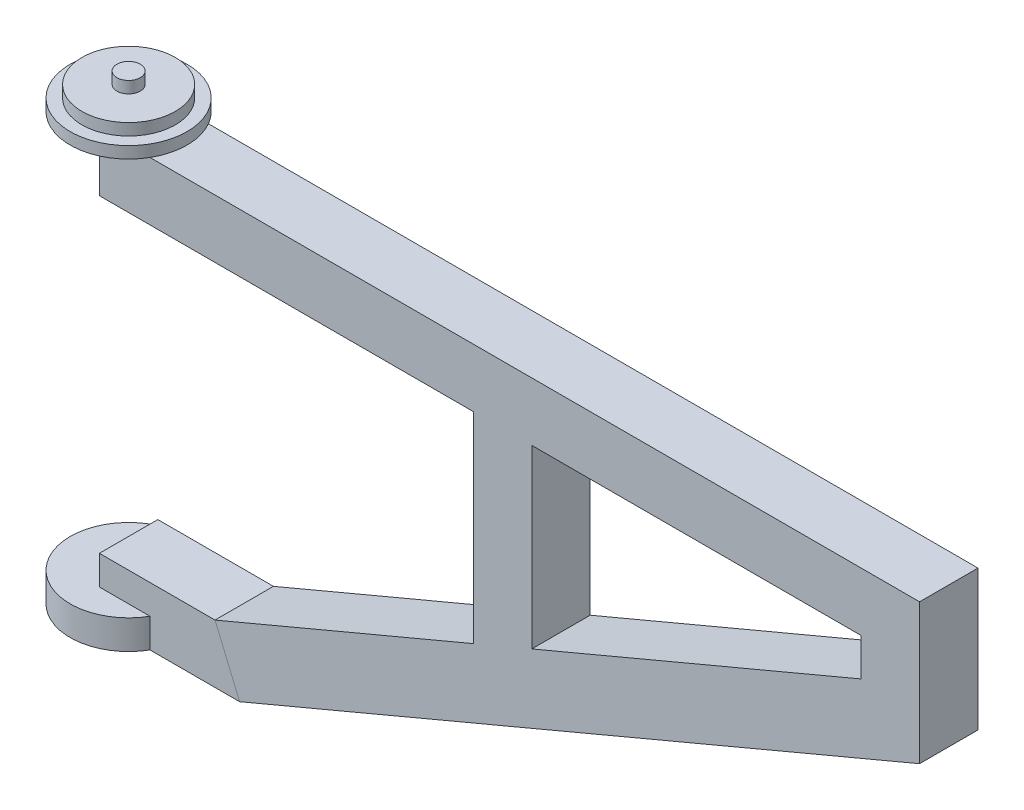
ISO-10303-21;
HEADER;
FILE_DESCRIPTION(('STEP AP214'),'2;1');
FILE_NAME('part.step','',(''),(''),'','','');
FILE_SCHEMA(('AUTOMOTIVE_DESIGN { 1 0 10303 214 1 1 1 1 }'));
ENDSEC;
DATA;
#1=APPLICATION_CONTEXT('core data for automotive mechanical design processes');
#2=APPLICATION_PROTOCOL_DEFINITION('international standard','automotive_design',2000,#1);
#3=PRODUCT_CONTEXT('',#1,'mechanical');
#4=PRODUCT('Part','Part','',(#3));
#5=PRODUCT_RELATED_PRODUCT_CATEGORY('part','',(#4));
#6=PRODUCT_DEFINITION_FORMATION('','',#4);
#7=PRODUCT_DEFINITION_CONTEXT('part definition',#1,'design');
#8=PRODUCT_DEFINITION('design','',#6,#7);
#9=PRODUCT_DEFINITION_SHAPE('','',#8);
#10=(LENGTH_UNIT() NAMED_UNIT(*) SI_UNIT(.MILLI.,.METRE.));
#11=(NAMED_UNIT(*) PLANE_ANGLE_UNIT() SI_UNIT($,.RADIAN.));
#12=(NAMED_UNIT(*) SI_UNIT($,.STERADIAN.) SOLID_ANGLE_UNIT());
#13=UNCERTAINTY_MEASURE_WITH_UNIT(LENGTH_MEASURE(1.E-05),#10,'distance_accuracy_value','');
#14=(GEOMETRIC_REPRESENTATION_CONTEXT(3) GLOBAL_UNCERTAINTY_ASSIGNED_CONTEXT((#13)) GLOBAL_UNIT_ASSIGNED_CONTEXT((#10,
#11,#12)) REPRESENTATION_CONTEXT('',''));
#15=CARTESIAN_POINT('',(0.,0.,0.));
#16=DIRECTION('',(0.,0.,1.));
#17=DIRECTION('',(1.,0.,0.));
#18=AXIS2_PLACEMENT_3D('',#15,#16,#17);
#19=CARTESIAN_POINT('',(0.,-438.15,31.75));
#20=DIRECTION('',(0.,0.,1.));
#21=DIRECTION('',(1.,0.,0.));
#22=AXIS2_PLACEMENT_3D('',#19,#20,#21);
#23=PLANE('',#22);
#24=DIRECTION('',(0.,1.,0.));
#25=VECTOR('',#24,1.);
#26=CARTESIAN_POINT('',(827.891767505,-38.1,31.75));
#27=LINE('',#26,#25);
#28=CARTESIAN_POINT('',(827.891767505,-142.47916429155,31.75));
#29=VERTEX_POINT('',#28);
#30=CARTESIAN_POINT('',(827.891767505,-101.6,31.75));
#31=VERTEX_POINT('',#30);
#32=EDGE_CURVE('E200',#29,#31,#27,.T.);
#33=ORIENTED_EDGE('',*,*,#32,.F.);
#34=DIRECTION('',(-0.921637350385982,-0.388052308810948,0.));
#35=VECTOR('',#34,1.);
#36=CARTESIAN_POINT('',(864.655305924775,-127.,31.75));
#37=LINE('',#36,#35);
#38=CARTESIAN_POINT('',(469.9,-293.2103948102,31.75));
#39=VERTEX_POINT('',#38);
#40=EDGE_CURVE('E162',#29,#39,#37,.T.);
#41=ORIENTED_EDGE('',*,*,#40,.T.);
#42=DIRECTION('',(0.,-1.,0.));
#43=VECTOR('',#42,1.);
#44=CARTESIAN_POINT('',(469.9,-38.1,31.75));
#45=LINE('',#44,#43);
#46=CARTESIAN_POINT('',(469.9,-101.6,31.75));
#47=VERTEX_POINT('',#46);
#48=EDGE_CURVE('E281',#47,#39,#45,.T.);
#49=ORIENTED_EDGE('',*,*,#48,.F.);
#50=DIRECTION('',(-1.,0.,0.));
#51=VECTOR('',#50,1.);
#52=CARTESIAN_POINT('',(0.,-101.6,31.75));
#53=LINE('',#52,#51);
#54=EDGE_CURVE('E194',#31,#47,#53,.T.);
#55=ORIENTED_EDGE('',*,*,#54,.F.);
#56=EDGE_LOOP('',(#33,#41,#49,#55));
#57=FACE_BOUND('',#56,.T.);
#58=DIRECTION('',(-0.921637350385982,-0.388052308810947,0.));
#59=VECTOR('',#58,1.);
#60=CARTESIAN_POINT('',(152.4,-501.65,31.75));
#61=LINE('',#60,#59);
#62=CARTESIAN_POINT('',(891.391767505,-190.5,31.75));
#63=VERTEX_POINT('',#62);
#64=CARTESIAN_POINT('',(152.4,-501.65,31.75));
#65=VERTEX_POINT('',#64);
#66=EDGE_CURVE('E65',#63,#65,#61,.T.);
#67=ORIENTED_EDGE('',*,*,#66,.F.);
#68=DIRECTION('',(0.,-1.,0.));
#69=VECTOR('',#68,1.);
#70=CARTESIAN_POINT('',(891.391767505,-438.15,31.75));
#71=LINE('',#70,#69);
#72=CARTESIAN_POINT('',(891.391767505,-38.1,31.75));
#73=VERTEX_POINT('',#72);
#74=EDGE_CURVE('E199',#73,#63,#71,.T.);
#75=ORIENTED_EDGE('',*,*,#74,.F.);
#76=DIRECTION('',(1.,0.,0.));
#77=VECTOR('',#76,1.);
#78=CARTESIAN_POINT('',(891.391767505,-38.1,31.75));
#79=LINE('',#78,#77);
#80=CARTESIAN_POINT('',(54.9926131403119,-38.1,31.75));
#81=VERTEX_POINT('',#80);
#82=EDGE_CURVE('E221',#81,#73,#79,.T.);
#83=ORIENTED_EDGE('',*,*,#82,.F.);
#84=DIRECTION('',(-1.,0.,0.));
#85=VECTOR('',#84,1.);
#86=CARTESIAN_POINT('',(0.,-38.1,31.75));
#87=LINE('',#86,#85);
#88=CARTESIAN_POINT('',(0.,-38.1,31.75));
#89=VERTEX_POINT('',#88);
#90=EDGE_CURVE('E182',#81,#89,#87,.T.);
#91=ORIENTED_EDGE('',*,*,#90,.T.);
#92=DIRECTION('',(0.,1.,0.));
#93=VECTOR('',#92,1.);
#94=CARTESIAN_POINT('',(0.,-101.6,31.75));
#95=LINE('',#94,#93);
#96=CARTESIAN_POINT('',(0.,-101.6,31.75));
#97=VERTEX_POINT('',#96);
#98=EDGE_CURVE('E252',#97,#89,#95,.T.);
#99=ORIENTED_EDGE('',*,*,#98,.F.);
#100=CARTESIAN_POINT('',(406.4,-101.6,31.75));
#101=VERTEX_POINT('',#100);
#102=EDGE_CURVE('E187',#101,#97,#53,.T.);
#103=ORIENTED_EDGE('',*,*,#102,.F.);
#104=DIRECTION('',(0.,1.,0.));
#105=VECTOR('',#104,1.);
#106=CARTESIAN_POINT('',(406.4,-38.1,31.75));
#107=LINE('',#106,#105);
#108=CARTESIAN_POINT('',(406.4,-319.946856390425,31.75));
#109=VERTEX_POINT('',#108);
#110=EDGE_CURVE('E285',#109,#101,#107,.T.);
#111=ORIENTED_EDGE('',*,*,#110,.F.);
#112=CARTESIAN_POINT('',(125.663538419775,-438.15,31.75));
#113=VERTEX_POINT('',#112);
#114=EDGE_CURVE('E158',#109,#113,#37,.T.);
#115=ORIENTED_EDGE('',*,*,#114,.T.);
#116=DIRECTION('',(0.388052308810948,-0.921637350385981,0.));
#117=VECTOR('',#116,1.);
#118=CARTESIAN_POINT('',(125.663538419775,-438.15,31.75));
#119=LINE('',#118,#117);
#120=EDGE_CURVE('E151',#113,#65,#119,.T.);
#121=ORIENTED_EDGE('',*,*,#120,.T.);
#122=EDGE_LOOP('',(#67,#75,#83,#91,#99,#103,#111,#115,#121));
#123=FACE_BOUND('',#122,.T.);
#124=ADVANCED_FACE('F49',(#57,#123),#23,.T.);
#125=CARTESIAN_POINT('',(0.,-101.6,0.));
#126=DIRECTION('',(0.,1.,0.));
#127=DIRECTION('',(0.,0.,1.));
#128=AXIS2_PLACEMENT_3D('',#125,#126,#127);
#129=PLANE('',#128);
#130=DIRECTION('',(1.,0.,0.));
#131=VECTOR('',#130,1.);
#132=CARTESIAN_POINT('',(0.,-101.6,-31.75));
#133=LINE('',#132,#131);
#134=CARTESIAN_POINT('',(0.,-101.6,-31.75));
#135=VERTEX_POINT('',#134);
#136=CARTESIAN_POINT('',(406.4,-101.6,-31.7499999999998));
#137=VERTEX_POINT('',#136);
#138=EDGE_CURVE('E188',#135,#137,#133,.T.);
#139=ORIENTED_EDGE('',*,*,#138,.T.);
#140=DIRECTION('',(0.,0.,1.));
#141=VECTOR('',#140,1.);
#142=CARTESIAN_POINT('',(406.4,-101.6,0.));
#143=LINE('',#142,#141);
#144=EDGE_CURVE('E183',#137,#101,#143,.T.);
#145=ORIENTED_EDGE('',*,*,#144,.T.);
#146=ORIENTED_EDGE('',*,*,#102,.T.);
#147=DIRECTION('',(0.,0.,-1.));
#148=VECTOR('',#147,1.);
#149=CARTESIAN_POINT('',(0.,-101.6,-31.75));
#150=LINE('',#149,#148);
#151=EDGE_CURVE('E227',#97,#135,#150,.T.);
#152=ORIENTED_EDGE('',*,*,#151,.T.);
#153=EDGE_LOOP('',(#139,#145,#146,#152));
#154=FACE_BOUND('',#153,.T.);
#155=ADVANCED_FACE('F321',(#154),#129,.F.);
#156=CARTESIAN_POINT('',(827.891767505,-38.1,31.75));
#157=DIRECTION('',(-1.,0.,0.));
#158=DIRECTION('',(0.,-1.,0.));
#159=AXIS2_PLACEMENT_3D('',#156,#157,#158);
#160=PLANE('',#159);
#161=DIRECTION('',(0.,0.,-1.));
#162=VECTOR('',#161,1.);
#163=CARTESIAN_POINT('',(827.891767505,-142.47916429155,31.75));
#164=LINE('',#163,#162);
#165=CARTESIAN_POINT('',(827.891767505,-142.47916429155,-31.7499999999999));
#166=VERTEX_POINT('',#165);
#167=EDGE_CURVE('E179',#29,#166,#164,.T.);
#168=ORIENTED_EDGE('',*,*,#167,.F.);
#169=ORIENTED_EDGE('',*,*,#32,.T.);
#170=DIRECTION('',(0.,0.,-1.));
#171=VECTOR('',#170,1.);
#172=CARTESIAN_POINT('',(827.891767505,-101.6,31.75));
#173=LINE('',#172,#171);
#174=CARTESIAN_POINT('',(827.891767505,-101.6,-31.75));
#175=VERTEX_POINT('',#174);
#176=EDGE_CURVE('E195',#31,#175,#173,.T.);
#177=ORIENTED_EDGE('',*,*,#176,.T.);
#178=DIRECTION('',(0.,1.,0.));
#179=VECTOR('',#178,1.);
#180=CARTESIAN_POINT('',(827.891767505,-38.1,-31.75));
#181=LINE('',#180,#179);
#182=EDGE_CURVE('E205',#166,#175,#181,.T.);
#183=ORIENTED_EDGE('',*,*,#182,.F.);
#184=EDGE_LOOP('',(#168,#169,#177,#183));
#185=FACE_BOUND('',#184,.T.);
#186=ADVANCED_FACE('F318',(#185),#160,.T.);
#187=CARTESIAN_POINT('',(891.391767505,-438.15,31.75));
#188=DIRECTION('',(1.,0.,0.));
#189=DIRECTION('',(0.,0.,-1.));
#190=AXIS2_PLACEMENT_3D('',#187,#188,#189);
#191=PLANE('',#190);
#192=DIRECTION('',(0.,0.,1.));
#193=VECTOR('',#192,1.);
#194=CARTESIAN_POINT('',(891.391767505,-190.5,-63.5));
#195=LINE('',#194,#193);
#196=CARTESIAN_POINT('',(891.391767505,-190.5,-31.75));
#197=VERTEX_POINT('',#196);
#198=EDGE_CURVE('E58',#197,#63,#195,.T.);
#199=ORIENTED_EDGE('',*,*,#198,.F.);
#200=DIRECTION('',(0.,-1.,0.));
#201=VECTOR('',#200,1.);
#202=CARTESIAN_POINT('',(891.391767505,-438.15,-31.75));
#203=LINE('',#202,#201);
#204=CARTESIAN_POINT('',(891.391767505,-38.1,-31.75));
#205=VERTEX_POINT('',#204);
#206=EDGE_CURVE('E201',#205,#197,#203,.T.);
#207=ORIENTED_EDGE('',*,*,#206,.F.);
#208=DIRECTION('',(0.,0.,-1.));
#209=VECTOR('',#208,1.);
#210=CARTESIAN_POINT('',(891.391767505,-38.1,31.75));
#211=LINE('',#210,#209);
#212=EDGE_CURVE('E210',#73,#205,#211,.T.);
#213=ORIENTED_EDGE('',*,*,#212,.F.);
#214=ORIENTED_EDGE('',*,*,#74,.T.);
#215=EDGE_LOOP('',(#199,#207,#213,#214));
#216=FACE_BOUND('',#215,.T.);
#217=ADVANCED_FACE('F320',(#216),#191,.T.);
#218=CARTESIAN_POINT('',(0.,-438.15,-31.75));
#219=DIRECTION('',(0.,0.,-1.));
#220=DIRECTION('',(-1.,0.,0.));
#221=AXIS2_PLACEMENT_3D('',#218,#219,#220);
#222=PLANE('',#221);
#223=DIRECTION('',(-0.921637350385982,-0.388052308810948,0.));
#224=VECTOR('',#223,1.);
#225=CARTESIAN_POINT('',(864.655305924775,-127.,-31.7499999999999));
#226=LINE('',#225,#224);
#227=CARTESIAN_POINT('',(469.9,-293.2103948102,-31.7499999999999));
#228=VERTEX_POINT('',#227);
#229=EDGE_CURVE('E166',#166,#228,#226,.T.);
#230=ORIENTED_EDGE('',*,*,#229,.F.);
#231=ORIENTED_EDGE('',*,*,#182,.T.);
#232=CARTESIAN_POINT('',(469.9,-101.6,-31.75));
#233=VERTEX_POINT('',#232);
#234=EDGE_CURVE('E193',#233,#175,#133,.T.);
#235=ORIENTED_EDGE('',*,*,#234,.F.);
#236=DIRECTION('',(0.,-1.,0.));
#237=VECTOR('',#236,1.);
#238=CARTESIAN_POINT('',(469.9,-38.1,-31.75));
#239=LINE('',#238,#237);
#240=EDGE_CURVE('E215',#233,#228,#239,.T.);
#241=ORIENTED_EDGE('',*,*,#240,.T.);
#242=EDGE_LOOP('',(#230,#231,#235,#241));
#243=FACE_BOUND('',#242,.T.);
#244=ORIENTED_EDGE('',*,*,#206,.T.);
#245=DIRECTION('',(0.921637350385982,0.388052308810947,0.));
#246=VECTOR('',#245,1.);
#247=CARTESIAN_POINT('',(45.6594545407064,-546.592747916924,-31.75));
#248=LINE('',#247,#246);
#249=CARTESIAN_POINT('',(152.4,-501.65,-31.7499999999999));
#250=VERTEX_POINT('',#249);
#251=EDGE_CURVE('E72',#250,#197,#248,.T.);
#252=ORIENTED_EDGE('',*,*,#251,.F.);
#253=DIRECTION('',(0.388052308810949,-0.921637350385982,0.));
#254=VECTOR('',#253,1.);
#255=CARTESIAN_POINT('',(125.663538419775,-438.15,-31.7499999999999));
#256=LINE('',#255,#254);
#257=CARTESIAN_POINT('',(125.663538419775,-438.15,-31.7499999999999));
#258=VERTEX_POINT('',#257);
#259=EDGE_CURVE('E153',#258,#250,#256,.T.);
#260=ORIENTED_EDGE('',*,*,#259,.F.);
#261=CARTESIAN_POINT('',(406.4,-319.946856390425,-31.7499999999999));
#262=VERTEX_POINT('',#261);
#263=EDGE_CURVE('E161',#262,#258,#226,.T.);
#264=ORIENTED_EDGE('',*,*,#263,.F.);
#265=DIRECTION('',(0.,1.,0.));
#266=VECTOR('',#265,1.);
#267=CARTESIAN_POINT('',(406.4,-38.1,-31.75));
#268=LINE('',#267,#266);
#269=EDGE_CURVE('E209',#262,#137,#268,.T.);
#270=ORIENTED_EDGE('',*,*,#269,.T.);
#271=ORIENTED_EDGE('',*,*,#138,.F.);
#272=DIRECTION('',(0.,1.,0.));
#273=VECTOR('',#272,1.);
#274=CARTESIAN_POINT('',(0.,-101.6,-31.75));
#275=LINE('',#274,#273);
#276=CARTESIAN_POINT('',(0.,-38.1,-31.75));
#277=VERTEX_POINT('',#276);
#278=EDGE_CURVE('E256',#135,#277,#275,.T.);
#279=ORIENTED_EDGE('',*,*,#278,.T.);
#280=DIRECTION('',(1.,0.,0.));
#281=VECTOR('',#280,1.);
#282=CARTESIAN_POINT('',(0.,-38.1,-31.75));
#283=LINE('',#282,#281);
#284=CARTESIAN_POINT('',(54.9926131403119,-38.1,-31.75));
#285=VERTEX_POINT('',#284);
#286=EDGE_CURVE('E218',#277,#285,#283,.T.);
#287=ORIENTED_EDGE('',*,*,#286,.T.);
#288=DIRECTION('',(1.,0.,0.));
#289=VECTOR('',#288,1.);
#290=CARTESIAN_POINT('',(891.391767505,-38.1,-31.75));
#291=LINE('',#290,#289);
#292=EDGE_CURVE('E206',#285,#205,#291,.T.);
#293=ORIENTED_EDGE('',*,*,#292,.T.);
#294=EDGE_LOOP('',(#244,#252,#260,#264,#270,#271,#279,#287,#293));
#295=FACE_BOUND('',#294,.T.);
#296=ADVANCED_FACE('F309',(#243,#295),#222,.T.);
#297=CARTESIAN_POINT('',(891.391767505,-38.1,31.75));
#298=DIRECTION('',(0.,1.,0.));
#299=DIRECTION('',(0.,0.,1.));
#300=AXIS2_PLACEMENT_3D('',#297,#298,#299);
#301=PLANE('',#300);
#302=ORIENTED_EDGE('',*,*,#212,.T.);
#303=ORIENTED_EDGE('',*,*,#292,.F.);
#304=CARTESIAN_POINT('',(0.,-38.1,0.));
#305=DIRECTION('',(0.,-1.,0.));
#306=DIRECTION('',(0.,0.,-1.));
#307=AXIS2_PLACEMENT_3D('',#304,#305,#306);
#308=CIRCLE('',#307,63.5);
#309=EDGE_CURVE('E214',#285,#81,#308,.T.);
#310=ORIENTED_EDGE('',*,*,#309,.T.);
#311=ORIENTED_EDGE('',*,*,#82,.T.);
#312=EDGE_LOOP('',(#302,#303,#310,#311));
#313=FACE_BOUND('',#312,.T.);
#314=ADVANCED_FACE('F338',(#313),#301,.T.);
#315=CARTESIAN_POINT('',(0.,-12.7,0.));
#316=DIRECTION('',(0.,1.,0.));
#317=DIRECTION('',(0.,0.,1.));
#318=AXIS2_PLACEMENT_3D('',#315,#316,#317);
#319=CYLINDRICAL_SURFACE('',#318,12.7);
#320=CARTESIAN_POINT('',(0.,-12.7,0.));
#321=DIRECTION('',(0.,1.,0.));
#322=DIRECTION('',(0.,0.,1.));
#323=AXIS2_PLACEMENT_3D('',#320,#321,#322);
#324=CIRCLE('',#323,12.7);
#325=CARTESIAN_POINT('',(0.,-12.7,12.7));
#326=VERTEX_POINT('',#325);
#327=EDGE_CURVE('E224',#326,#326,#324,.T.);
#328=ORIENTED_EDGE('',*,*,#327,.T.);
#329=EDGE_LOOP('',(#328));
#330=FACE_BOUND('',#329,.T.);
#331=CARTESIAN_POINT('',(0.,0.,0.));
#332=DIRECTION('',(0.,1.,0.));
#333=DIRECTION('',(0.,0.,1.));
#334=AXIS2_PLACEMENT_3D('',#331,#332,#333);
#335=CIRCLE('',#334,12.7);
#336=CARTESIAN_POINT('',(0.,0.,12.7));
#337=VERTEX_POINT('',#336);
#338=EDGE_CURVE('E228',#337,#337,#335,.T.);
#339=ORIENTED_EDGE('',*,*,#338,.F.);
#340=EDGE_LOOP('',(#339));
#341=FACE_BOUND('',#340,.T.);
#342=ADVANCED_FACE('F373',(#330,#341),#319,.T.);
#343=CARTESIAN_POINT('',(0.,0.,0.));
#344=DIRECTION('',(0.,1.,0.));
#345=DIRECTION('',(0.,0.,1.));
#346=AXIS2_PLACEMENT_3D('',#343,#344,#345);
#347=PLANE('',#346);
#348=ORIENTED_EDGE('',*,*,#338,.T.);
#349=EDGE_LOOP('',(#348));
#350=FACE_BOUND('',#349,.T.);
#351=ADVANCED_FACE('F369',(#350),#347,.T.);
#352=CARTESIAN_POINT('',(0.,-25.4,0.));
#353=DIRECTION('',(0.,1.,0.));
#354=DIRECTION('',(0.,0.,1.));
#355=AXIS2_PLACEMENT_3D('',#352,#353,#354);
#356=CYLINDRICAL_SURFACE('',#355,50.8);
#357=CARTESIAN_POINT('',(0.,-25.4,0.));
#358=DIRECTION('',(0.,-1.,0.));
#359=DIRECTION('',(0.,0.,-1.));
#360=AXIS2_PLACEMENT_3D('',#357,#358,#359);
#361=CIRCLE('',#360,50.8);
#362=CARTESIAN_POINT('',(0.,-25.4,-50.8));
#363=VERTEX_POINT('',#362);
#364=EDGE_CURVE('E240',#363,#363,#361,.T.);
#365=ORIENTED_EDGE('',*,*,#364,.F.);
#366=EDGE_LOOP('',(#365));
#367=FACE_BOUND('',#366,.T.);
#368=CARTESIAN_POINT('',(0.,-12.7,0.));
#369=DIRECTION('',(0.,-1.,0.));
#370=DIRECTION('',(0.,0.,-1.));
#371=AXIS2_PLACEMENT_3D('',#368,#369,#370);
#372=CIRCLE('',#371,50.8);
#373=CARTESIAN_POINT('',(0.,-12.7,-50.8));
#374=VERTEX_POINT('',#373);
#375=EDGE_CURVE('E232',#374,#374,#372,.T.);
#376=ORIENTED_EDGE('',*,*,#375,.T.);
#377=EDGE_LOOP('',(#376));
#378=FACE_BOUND('',#377,.T.);
#379=ADVANCED_FACE('F365',(#367,#378),#356,.T.);
#380=CARTESIAN_POINT('',(0.,-12.7,0.));
#381=DIRECTION('',(0.,-1.,0.));
#382=DIRECTION('',(0.,0.,-1.));
#383=AXIS2_PLACEMENT_3D('',#380,#381,#382);
#384=PLANE('',#383);
#385=ORIENTED_EDGE('',*,*,#327,.F.);
#386=EDGE_LOOP('',(#385));
#387=FACE_BOUND('',#386,.T.);
#388=ORIENTED_EDGE('',*,*,#375,.F.);
#389=EDGE_LOOP('',(#388));
#390=FACE_BOUND('',#389,.T.);
#391=ADVANCED_FACE('F361',(#387,#390),#384,.F.);
#392=CARTESIAN_POINT('',(0.,-38.1,0.));
#393=DIRECTION('',(0.,1.,0.));
#394=DIRECTION('',(0.,0.,1.));
#395=AXIS2_PLACEMENT_3D('',#392,#393,#394);
#396=CYLINDRICAL_SURFACE('',#395,63.5);
#397=ORIENTED_EDGE('',*,*,#309,.F.);
#398=EDGE_CURVE('E245',#81,#285,#308,.T.);
#399=ORIENTED_EDGE('',*,*,#398,.F.);
#400=EDGE_LOOP('',(#397,#399));
#401=FACE_BOUND('',#400,.T.);
#402=CARTESIAN_POINT('',(0.,-25.4,0.));
#403=DIRECTION('',(0.,-1.,0.));
#404=DIRECTION('',(0.,0.,-1.));
#405=AXIS2_PLACEMENT_3D('',#402,#403,#404);
#406=CIRCLE('',#405,63.5);
#407=CARTESIAN_POINT('',(0.,-25.4,-63.5));
#408=VERTEX_POINT('',#407);
#409=EDGE_CURVE('E239',#408,#408,#406,.T.);
#410=ORIENTED_EDGE('',*,*,#409,.T.);
#411=EDGE_LOOP('',(#410));
#412=FACE_BOUND('',#411,.T.);
#413=ADVANCED_FACE('F354',(#401,#412),#396,.T.);
#414=CARTESIAN_POINT('',(0.,-38.1,0.));
#415=DIRECTION('',(0.,-1.,0.));
#416=DIRECTION('',(0.,0.,-1.));
#417=AXIS2_PLACEMENT_3D('',#414,#415,#416);
#418=PLANE('',#417);
#419=ORIENTED_EDGE('',*,*,#286,.F.);
#420=DIRECTION('',(0.,0.,-1.));
#421=VECTOR('',#420,1.);
#422=CARTESIAN_POINT('',(0.,-38.1,-31.75));
#423=LINE('',#422,#421);
#424=EDGE_CURVE('E244',#89,#277,#423,.T.);
#425=ORIENTED_EDGE('',*,*,#424,.F.);
#426=ORIENTED_EDGE('',*,*,#90,.F.);
#427=ORIENTED_EDGE('',*,*,#398,.T.);
#428=EDGE_LOOP('',(#419,#425,#426,#427));
#429=FACE_BOUND('',#428,.T.);
#430=ADVANCED_FACE('F351',(#429),#418,.T.);
#431=CARTESIAN_POINT('',(0.,-25.4,0.));
#432=DIRECTION('',(0.,-1.,0.));
#433=DIRECTION('',(0.,0.,-1.));
#434=AXIS2_PLACEMENT_3D('',#431,#432,#433);
#435=PLANE('',#434);
#436=ORIENTED_EDGE('',*,*,#364,.T.);
#437=EDGE_LOOP('',(#436));
#438=FACE_BOUND('',#437,.T.);
#439=ORIENTED_EDGE('',*,*,#409,.F.);
#440=EDGE_LOOP('',(#439));
#441=FACE_BOUND('',#440,.T.);
#442=ADVANCED_FACE('F349',(#438,#441),#435,.F.);
#443=CARTESIAN_POINT('',(0.,-101.6,-31.75));
#444=DIRECTION('',(1.,0.,0.));
#445=DIRECTION('',(0.,0.,-1.));
#446=AXIS2_PLACEMENT_3D('',#443,#444,#445);
#447=PLANE('',#446);
#448=ORIENTED_EDGE('',*,*,#424,.T.);
#449=ORIENTED_EDGE('',*,*,#278,.F.);
#450=ORIENTED_EDGE('',*,*,#151,.F.);
#451=ORIENTED_EDGE('',*,*,#98,.T.);
#452=EDGE_LOOP('',(#448,#449,#450,#451));
#453=FACE_BOUND('',#452,.T.);
#454=ADVANCED_FACE('F346',(#453),#447,.F.);
#455=ORIENTED_EDGE('',*,*,#54,.T.);
#456=DIRECTION('',(0.,0.,-1.));
#457=VECTOR('',#456,1.);
#458=CARTESIAN_POINT('',(469.9,-101.6,0.));
#459=LINE('',#458,#457);
#460=EDGE_CURVE('E189',#47,#233,#459,.T.);
#461=ORIENTED_EDGE('',*,*,#460,.T.);
#462=ORIENTED_EDGE('',*,*,#234,.T.);
#463=ORIENTED_EDGE('',*,*,#176,.F.);
#464=EDGE_LOOP('',(#455,#461,#462,#463));
#465=FACE_BOUND('',#464,.T.);
#466=ADVANCED_FACE('F313',(#465),#129,.F.);
#467=CARTESIAN_POINT('',(406.4,-38.1,31.75));
#468=DIRECTION('',(-1.,0.,0.));
#469=DIRECTION('',(0.,-1.,0.));
#470=AXIS2_PLACEMENT_3D('',#467,#468,#469);
#471=PLANE('',#470);
#472=DIRECTION('',(0.,0.,-1.));
#473=VECTOR('',#472,1.);
#474=CARTESIAN_POINT('',(406.4,-319.946856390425,31.75));
#475=LINE('',#474,#473);
#476=EDGE_CURVE('E155',#109,#262,#475,.T.);
#477=ORIENTED_EDGE('',*,*,#476,.F.);
#478=ORIENTED_EDGE('',*,*,#110,.T.);
#479=ORIENTED_EDGE('',*,*,#144,.F.);
#480=ORIENTED_EDGE('',*,*,#269,.F.);
#481=EDGE_LOOP('',(#477,#478,#479,#480));
#482=FACE_BOUND('',#481,.T.);
#483=ADVANCED_FACE('F341',(#482),#471,.T.);
#484=CARTESIAN_POINT('',(469.9,-38.1,31.75));
#485=DIRECTION('',(1.,0.,0.));
#486=DIRECTION('',(0.,1.,0.));
#487=AXIS2_PLACEMENT_3D('',#484,#485,#486);
#488=PLANE('',#487);
#489=DIRECTION('',(0.,0.,1.));
#490=VECTOR('',#489,1.);
#491=CARTESIAN_POINT('',(469.9,-293.2103948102,31.75));
#492=LINE('',#491,#490);
#493=EDGE_CURVE('E12',#228,#39,#492,.T.);
#494=ORIENTED_EDGE('',*,*,#493,.F.);
#495=ORIENTED_EDGE('',*,*,#240,.F.);
#496=ORIENTED_EDGE('',*,*,#460,.F.);
#497=ORIENTED_EDGE('',*,*,#48,.T.);
#498=EDGE_LOOP('',(#494,#495,#496,#497));
#499=FACE_BOUND('',#498,.T.);
#500=ADVANCED_FACE('F306',(#499),#488,.T.);
#501=CARTESIAN_POINT('',(152.4,-501.65,-63.5));
#502=DIRECTION('',(-0.388052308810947,0.921637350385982,0.));
#503=DIRECTION('',(-0.921637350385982,-0.388052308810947,0.));
#504=AXIS2_PLACEMENT_3D('',#501,#502,#503);
#505=PLANE('',#504);
#506=ORIENTED_EDGE('',*,*,#66,.T.);
#507=DIRECTION('',(0.,0.,1.));
#508=VECTOR('',#507,1.);
#509=CARTESIAN_POINT('',(152.4,-501.65,-884.218382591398));
#510=LINE('',#509,#508);
#511=EDGE_CURVE('E143',#250,#65,#510,.T.);
#512=ORIENTED_EDGE('',*,*,#511,.F.);
#513=ORIENTED_EDGE('',*,*,#251,.T.);
#514=ORIENTED_EDGE('',*,*,#198,.T.);
#515=EDGE_LOOP('',(#506,#512,#513,#514));
#516=FACE_BOUND('',#515,.T.);
#517=ADVANCED_FACE('F51',(#516),#505,.F.);
#518=CARTESIAN_POINT('',(864.655305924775,-127.,-884.218382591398));
#519=DIRECTION('',(-0.388052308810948,0.921637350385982,0.));
#520=DIRECTION('',(-0.921637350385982,-0.388052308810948,0.));
#521=AXIS2_PLACEMENT_3D('',#518,#519,#520);
#522=PLANE('',#521);
#523=ORIENTED_EDGE('',*,*,#40,.F.);
#524=ORIENTED_EDGE('',*,*,#167,.T.);
#525=ORIENTED_EDGE('',*,*,#229,.T.);
#526=ORIENTED_EDGE('',*,*,#493,.T.);
#527=EDGE_LOOP('',(#523,#524,#525,#526));
#528=FACE_BOUND('',#527,.T.);
#529=ADVANCED_FACE('F300',(#528),#522,.T.);
#530=ORIENTED_EDGE('',*,*,#114,.F.);
#531=ORIENTED_EDGE('',*,*,#476,.T.);
#532=ORIENTED_EDGE('',*,*,#263,.T.);
#533=DIRECTION('',(0.,0.,1.));
#534=VECTOR('',#533,1.);
#535=CARTESIAN_POINT('',(125.663538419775,-438.15,-884.218382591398));
#536=LINE('',#535,#534);
#537=EDGE_CURVE('E173',#258,#113,#536,.T.);
#538=ORIENTED_EDGE('',*,*,#537,.T.);
#539=EDGE_LOOP('',(#530,#531,#532,#538));
#540=FACE_BOUND('',#539,.T.);
#541=ADVANCED_FACE('F399',(#540),#522,.T.);
#542=CARTESIAN_POINT('',(125.663538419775,-438.15,-884.218382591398));
#543=DIRECTION('',(-0.921637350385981,-0.388052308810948,0.));
#544=DIRECTION('',(0.388052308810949,-0.921637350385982,0.));
#545=AXIS2_PLACEMENT_3D('',#542,#543,#544);
#546=PLANE('',#545);
#547=ORIENTED_EDGE('',*,*,#537,.F.);
#548=ORIENTED_EDGE('',*,*,#259,.T.);
#549=ORIENTED_EDGE('',*,*,#511,.T.);
#550=ORIENTED_EDGE('',*,*,#120,.F.);
#551=EDGE_LOOP('',(#547,#548,#549,#550));
#552=FACE_BOUND('',#551,.T.);
#553=ADVANCED_FACE('F150',(#552),#546,.T.);
#554=CLOSED_SHELL('',(#124,#155,#186,#217,#296,#314,#342,#351,#379,#391,#413,#430,#442,#454,
#466,#483,#500,#517,#529,#541,#553));
#555=MANIFOLD_SOLID_BREP('B2',#554);
#556=CARTESIAN_POINT('',(0.,-438.15,31.75));
#557=DIRECTION('',(-1.,0.,0.));
#558=DIRECTION('',(0.,0.,1.));
#559=AXIS2_PLACEMENT_3D('',#556,#557,#558);
#560=PLANE('',#559);
#561=DIRECTION('',(0.,0.,-1.));
#562=VECTOR('',#561,1.);
#563=CARTESIAN_POINT('',(0.,-469.9,0.));
#564=LINE('',#563,#562);
#565=CARTESIAN_POINT('',(0.,-469.9,31.75));
#566=VERTEX_POINT('',#565);
#567=CARTESIAN_POINT('',(0.,-469.9,-31.75));
#568=VERTEX_POINT('',#567);
#569=EDGE_CURVE('E666',#566,#568,#564,.T.);
#570=ORIENTED_EDGE('',*,*,#569,.F.);
#571=DIRECTION('',(0.,-1.,0.));
#572=VECTOR('',#571,1.);
#573=CARTESIAN_POINT('',(0.,-438.15,31.75));
#574=LINE('',#573,#572);
#575=CARTESIAN_POINT('',(0.,-438.15,31.75));
#576=VERTEX_POINT('',#575);
#577=EDGE_CURVE('E652',#576,#566,#574,.T.);
#578=ORIENTED_EDGE('',*,*,#577,.F.);
#579=DIRECTION('',(0.,0.,-1.));
#580=VECTOR('',#579,1.);
#581=CARTESIAN_POINT('',(0.,-438.15,31.75));
#582=LINE('',#581,#580);
#583=CARTESIAN_POINT('',(0.,-438.15,-31.75));
#584=VERTEX_POINT('',#583);
#585=EDGE_CURVE('E644',#576,#584,#582,.T.);
#586=ORIENTED_EDGE('',*,*,#585,.T.);
#587=DIRECTION('',(0.,-1.,0.));
#588=VECTOR('',#587,1.);
#589=CARTESIAN_POINT('',(0.,-438.15,-31.75));
#590=LINE('',#589,#588);
#591=EDGE_CURVE('E656',#584,#568,#590,.T.);
#592=ORIENTED_EDGE('',*,*,#591,.T.);
#593=EDGE_LOOP('',(#570,#578,#586,#592));
#594=FACE_BOUND('',#593,.T.);
#595=ADVANCED_FACE('F572',(#594),#560,.T.);
#596=CARTESIAN_POINT('',(0.,-469.9,0.));
#597=DIRECTION('',(0.,-1.,0.));
#598=DIRECTION('',(0.,0.,-1.));
#599=AXIS2_PLACEMENT_3D('',#596,#597,#598);
#600=PLANE('',#599);
#601=CARTESIAN_POINT('',(0.,-469.9,0.));
#602=DIRECTION('',(0.,-1.,0.));
#603=DIRECTION('',(0.,0.,-1.));
#604=AXIS2_PLACEMENT_3D('',#601,#602,#603);
#605=CIRCLE('',#604,63.5);
#606=CARTESIAN_POINT('',(54.9926131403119,-469.9,31.75));
#607=VERTEX_POINT('',#606);
#608=CARTESIAN_POINT('',(54.9926131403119,-469.9,-31.75));
#609=VERTEX_POINT('',#608);
#610=EDGE_CURVE('E47',#607,#609,#605,.T.);
#611=ORIENTED_EDGE('',*,*,#610,.F.);
#612=DIRECTION('',(-1.,0.,0.));
#613=VECTOR('',#612,1.);
#614=CARTESIAN_POINT('',(0.,-469.9,31.75));
#615=LINE('',#614,#613);
#616=EDGE_CURVE('E662',#607,#566,#615,.T.);
#617=ORIENTED_EDGE('',*,*,#616,.T.);
#618=ORIENTED_EDGE('',*,*,#569,.T.);
#619=DIRECTION('',(1.,0.,0.));
#620=VECTOR('',#619,1.);
#621=CARTESIAN_POINT('',(0.,-469.9,-31.75));
#622=LINE('',#621,#620);
#623=EDGE_CURVE('E655',#568,#609,#622,.T.);
#624=ORIENTED_EDGE('',*,*,#623,.T.);
#625=EDGE_LOOP('',(#611,#617,#618,#624));
#626=FACE_BOUND('',#625,.T.);
#627=ADVANCED_FACE('F671',(#626),#600,.F.);
#628=CARTESIAN_POINT('',(0.,-469.9,0.));
#629=DIRECTION('',(0.,-1.,0.));
#630=DIRECTION('',(0.,0.,-1.));
#631=AXIS2_PLACEMENT_3D('',#628,#629,#630);
#632=CYLINDRICAL_SURFACE('',#631,63.5);
#633=DIRECTION('',(0.,-1.,0.));
#634=VECTOR('',#633,1.);
#635=CARTESIAN_POINT('',(54.9926131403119,-469.9,31.75));
#636=LINE('',#635,#634);
#637=CARTESIAN_POINT('',(54.9926131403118,-501.65,31.75));
#638=VERTEX_POINT('',#637);
#639=EDGE_CURVE('E642',#607,#638,#636,.T.);
#640=ORIENTED_EDGE('',*,*,#639,.F.);
#641=ORIENTED_EDGE('',*,*,#610,.T.);
#642=DIRECTION('',(0.,-1.,0.));
#643=VECTOR('',#642,1.);
#644=CARTESIAN_POINT('',(54.9926131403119,-469.9,-31.75));
#645=LINE('',#644,#643);
#646=CARTESIAN_POINT('',(54.9926131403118,-501.65,-31.75));
#647=VERTEX_POINT('',#646);
#648=EDGE_CURVE('E595',#647,#609,#645,.F.);
#649=ORIENTED_EDGE('',*,*,#648,.F.);
#650=CARTESIAN_POINT('',(0.,-501.65,0.));
#651=DIRECTION('',(0.,-1.,0.));
#652=DIRECTION('',(0.,0.,-1.));
#653=AXIS2_PLACEMENT_3D('',#650,#651,#652);
#654=CIRCLE('',#653,63.5);
#655=EDGE_CURVE('E576',#638,#647,#654,.T.);
#656=ORIENTED_EDGE('',*,*,#655,.F.);
#657=EDGE_LOOP('',(#640,#641,#649,#656));
#658=FACE_BOUND('',#657,.T.);
#659=ADVANCED_FACE('F574',(#658),#632,.T.);
#660=CARTESIAN_POINT('',(0.,-438.15,-31.75));
#661=DIRECTION('',(0.,0.,-1.));
#662=DIRECTION('',(-1.,0.,0.));
#663=AXIS2_PLACEMENT_3D('',#660,#661,#662);
#664=PLANE('',#663);
#665=DIRECTION('',(0.921637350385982,0.388052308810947,0.));
#666=VECTOR('',#665,1.);
#667=CARTESIAN_POINT('',(45.6594545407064,-546.592747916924,-31.75));
#668=LINE('',#667,#666);
#669=CARTESIAN_POINT('',(152.4,-501.65,-31.75));
#670=VERTEX_POINT('',#669);
#671=CARTESIAN_POINT('',(303.214646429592,-438.15,-31.75));
#672=VERTEX_POINT('',#671);
#673=EDGE_CURVE('E638',#670,#672,#668,.T.);
#674=ORIENTED_EDGE('',*,*,#673,.F.);
#675=DIRECTION('',(1.,0.,0.));
#676=VECTOR('',#675,1.);
#677=CARTESIAN_POINT('',(0.,-501.65,-31.75));
#678=LINE('',#677,#676);
#679=EDGE_CURVE('E637',#647,#670,#678,.T.);
#680=ORIENTED_EDGE('',*,*,#679,.F.);
#681=ORIENTED_EDGE('',*,*,#648,.T.);
#682=ORIENTED_EDGE('',*,*,#623,.F.);
#683=ORIENTED_EDGE('',*,*,#591,.F.);
#684=DIRECTION('',(1.,0.,0.));
#685=VECTOR('',#684,1.);
#686=CARTESIAN_POINT('',(0.,-438.15,-31.75));
#687=LINE('',#686,#685);
#688=EDGE_CURVE('E647',#584,#672,#687,.T.);
#689=ORIENTED_EDGE('',*,*,#688,.T.);
#690=EDGE_LOOP('',(#674,#680,#681,#682,#683,#689));
#691=FACE_BOUND('',#690,.T.);
#692=ADVANCED_FACE('F672',(#691),#664,.T.);
#693=CARTESIAN_POINT('',(0.,-438.15,31.75));
#694=DIRECTION('',(0.,0.,1.));
#695=DIRECTION('',(1.,0.,0.));
#696=AXIS2_PLACEMENT_3D('',#693,#694,#695);
#697=PLANE('',#696);
#698=DIRECTION('',(-0.921637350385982,-0.388052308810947,0.));
#699=VECTOR('',#698,1.);
#700=CARTESIAN_POINT('',(152.4,-501.65,31.75));
#701=LINE('',#700,#699);
#702=CARTESIAN_POINT('',(303.214646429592,-438.15,31.75));
#703=VERTEX_POINT('',#702);
#704=CARTESIAN_POINT('',(152.4,-501.65,31.75));
#705=VERTEX_POINT('',#704);
#706=EDGE_CURVE('E623',#703,#705,#701,.T.);
#707=ORIENTED_EDGE('',*,*,#706,.F.);
#708=DIRECTION('',(-1.,0.,0.));
#709=VECTOR('',#708,1.);
#710=CARTESIAN_POINT('',(0.,-438.15,31.75));
#711=LINE('',#710,#709);
#712=EDGE_CURVE('E659',#703,#576,#711,.T.);
#713=ORIENTED_EDGE('',*,*,#712,.T.);
#714=ORIENTED_EDGE('',*,*,#577,.T.);
#715=ORIENTED_EDGE('',*,*,#616,.F.);
#716=ORIENTED_EDGE('',*,*,#639,.T.);
#717=DIRECTION('',(-1.,0.,0.));
#718=VECTOR('',#717,1.);
#719=CARTESIAN_POINT('',(0.,-501.65,31.75));
#720=LINE('',#719,#718);
#721=EDGE_CURVE('E635',#705,#638,#720,.T.);
#722=ORIENTED_EDGE('',*,*,#721,.F.);
#723=EDGE_LOOP('',(#707,#713,#714,#715,#716,#722));
#724=FACE_BOUND('',#723,.T.);
#725=ADVANCED_FACE('F640',(#724),#697,.T.);
#726=CARTESIAN_POINT('',(0.,-501.65,0.));
#727=DIRECTION('',(0.,-1.,0.));
#728=DIRECTION('',(0.,0.,-1.));
#729=AXIS2_PLACEMENT_3D('',#726,#727,#728);
#730=PLANE('',#729);
#731=DIRECTION('',(0.,0.,1.));
#732=VECTOR('',#731,1.);
#733=CARTESIAN_POINT('',(152.4,-501.65,-63.5));
#734=LINE('',#733,#732);
#735=EDGE_CURVE('E587',#670,#705,#734,.T.);
#736=ORIENTED_EDGE('',*,*,#735,.T.);
#737=ORIENTED_EDGE('',*,*,#721,.T.);
#738=ORIENTED_EDGE('',*,*,#655,.T.);
#739=ORIENTED_EDGE('',*,*,#679,.T.);
#740=EDGE_LOOP('',(#736,#737,#738,#739));
#741=FACE_BOUND('',#740,.T.);
#742=ADVANCED_FACE('F633',(#741),#730,.T.);
#743=CARTESIAN_POINT('',(0.,-438.15,0.));
#744=DIRECTION('',(0.,-1.,0.));
#745=DIRECTION('',(0.,0.,-1.));
#746=AXIS2_PLACEMENT_3D('',#743,#744,#745);
#747=PLANE('',#746);
#748=ORIENTED_EDGE('',*,*,#712,.F.);
#749=DIRECTION('',(0.,0.,-1.));
#750=VECTOR('',#749,1.);
#751=CARTESIAN_POINT('',(303.214646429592,-438.15,0.));
#752=LINE('',#751,#750);
#753=EDGE_CURVE('E626',#703,#672,#752,.T.);
#754=ORIENTED_EDGE('',*,*,#753,.T.);
#755=ORIENTED_EDGE('',*,*,#688,.F.);
#756=ORIENTED_EDGE('',*,*,#585,.F.);
#757=EDGE_LOOP('',(#748,#754,#755,#756));
#758=FACE_BOUND('',#757,.T.);
#759=ADVANCED_FACE('F679',(#758),#747,.F.);
#760=CARTESIAN_POINT('',(152.4,-501.65,-63.5));
#761=DIRECTION('',(-0.388052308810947,0.921637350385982,0.));
#762=DIRECTION('',(-0.921637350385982,-0.388052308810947,0.));
#763=AXIS2_PLACEMENT_3D('',#760,#761,#762);
#764=PLANE('',#763);
#765=ORIENTED_EDGE('',*,*,#706,.T.);
#766=ORIENTED_EDGE('',*,*,#735,.F.);
#767=ORIENTED_EDGE('',*,*,#673,.T.);
#768=ORIENTED_EDGE('',*,*,#753,.F.);
#769=EDGE_LOOP('',(#765,#766,#767,#768));
#770=FACE_BOUND('',#769,.T.);
#771=ADVANCED_FACE('F624',(#770),#764,.F.);
#772=CLOSED_SHELL('',(#595,#627,#659,#692,#725,#742,#759,#771));
#773=MANIFOLD_SOLID_BREP('B6',#772);
#774=ADVANCED_BREP_SHAPE_REPRESENTATION('',(#18,#555,#773),#14);
#775=SHAPE_DEFINITION_REPRESENTATION(#9,#774);
ENDSEC;
END-ISO-10303-21;
